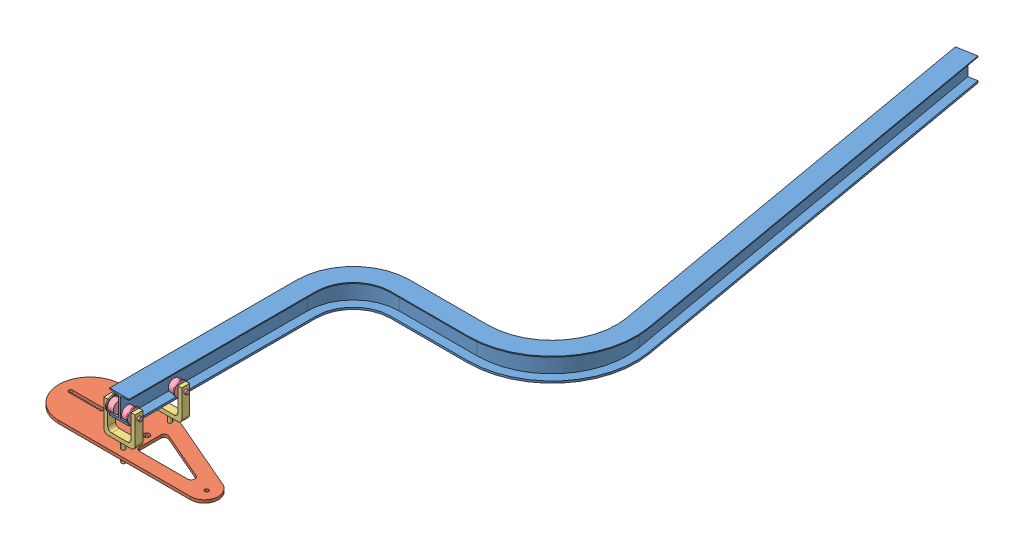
SolidWorks assembly Lesson7.SLDASM, configuration Default (file format 4100). Lengths in mm.
Overall size (965.75 199.9 2367.23).
9 component instances, 4 part files, 3 mates.
Components (placement in the parent):
- Rail-1: Rail.SLDPRT [Default] at origin size (711.2 76.2 2351.45)
- Carriage-1: Carriage.SLDASM [Default] at (0 -120.523 -31.75) size (576.05 178.13 209.91)
  - Base Plate-1: Base Plate.SLDPRT [Default] at origin size (576.05 9.53 203.2)
  - Steerer-1: Steerer.SLDPRT [Default] at (0 34.925 -133.35) size (101.6 165.1 25.4)
  - Steerer-2: Steerer.SLDPRT [Default] at (0 34.925 19.05) size (101.6 165.1 25.4)
  - Wheels-1: Wheels.SLDPRT [Default] at (-32.385 120.523 -133.35) size (43.81 44.45 44.45)
  - Wheels-2: Wheels.SLDPRT [Default] at (-32.385 120.523 19.05) size (43.81 44.45 44.45)
  - Wheels-3: Wheels.SLDPRT [Default] at (32.385 120.523 -133.35) x (-1 0 0) z (0 -0.924225 -0.381849) size (43.81 44.45 44.45)
  - Wheels-4: Wheels.SLDPRT [Default] at (32.385 120.523 19.05) x (-1 0 0) z (0 -0.939858 0.341565) size (43.81 44.45 44.45)
Mates (geometry in assembly coordinates):
- Coincident1: coincident: plane of Rail-1 through (-31.75 50.8 0) normal (0 0 1); plane of Carriage-1/Steerer-2 through (-25.4 -60.198 0) normal (0 0 1)
- PathMate1: path: point of Carriage-1/Base Plate-1; curve of Rail-1; line of Rail-1 through (-3.175 44.45 0) axis (0 -1 0)
- PathMate3: path: unknown of Carriage-1/Base Plate-1; edge_curve of Rail-1
